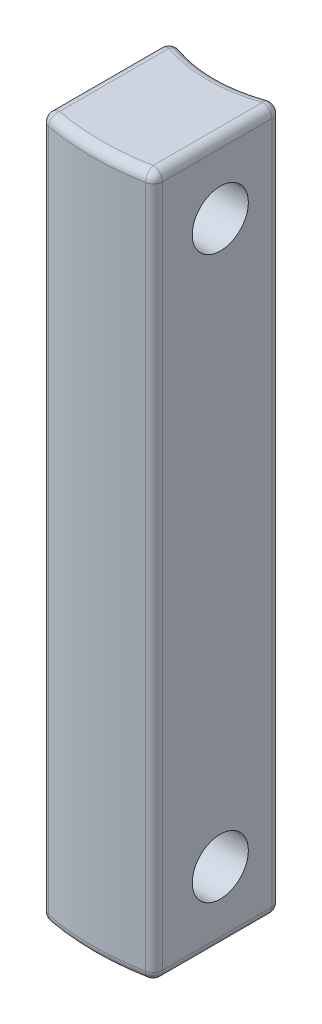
ISO-10303-21;
HEADER;
FILE_DESCRIPTION(('STEP AP214'),'2;1');
FILE_NAME('part.step','',(''),(''),'','','');
FILE_SCHEMA(('AUTOMOTIVE_DESIGN { 1 0 10303 214 1 1 1 1 }'));
ENDSEC;
DATA;
#1=APPLICATION_CONTEXT('core data for automotive mechanical design processes');
#2=APPLICATION_PROTOCOL_DEFINITION('international standard','automotive_design',2000,#1);
#3=PRODUCT_CONTEXT('',#1,'mechanical');
#4=PRODUCT('Part','Part','',(#3));
#5=PRODUCT_RELATED_PRODUCT_CATEGORY('part','',(#4));
#6=PRODUCT_DEFINITION_FORMATION('','',#4);
#7=PRODUCT_DEFINITION_CONTEXT('part definition',#1,'design');
#8=PRODUCT_DEFINITION('design','',#6,#7);
#9=PRODUCT_DEFINITION_SHAPE('','',#8);
#10=(LENGTH_UNIT() NAMED_UNIT(*) SI_UNIT(.MILLI.,.METRE.));
#11=(NAMED_UNIT(*) PLANE_ANGLE_UNIT() SI_UNIT($,.RADIAN.));
#12=(NAMED_UNIT(*) SI_UNIT($,.STERADIAN.) SOLID_ANGLE_UNIT());
#13=UNCERTAINTY_MEASURE_WITH_UNIT(LENGTH_MEASURE(1.E-05),#10,'distance_accuracy_value','');
#14=(GEOMETRIC_REPRESENTATION_CONTEXT(3) GLOBAL_UNCERTAINTY_ASSIGNED_CONTEXT((#13)) GLOBAL_UNIT_ASSIGNED_CONTEXT((#10,
#11,#12)) REPRESENTATION_CONTEXT('',''));
#15=CARTESIAN_POINT('',(0.,0.,0.));
#16=DIRECTION('',(0.,0.,1.));
#17=DIRECTION('',(1.,0.,0.));
#18=AXIS2_PLACEMENT_3D('',#15,#16,#17);
#19=CARTESIAN_POINT('',(4.25525865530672,37.5,-19.6491106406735));
#20=DIRECTION('',(0.,-1.,0.));
#21=DIRECTION('',(0.,0.,-1.));
#22=AXIS2_PLACEMENT_3D('',#19,#20,#21);
#23=CYLINDRICAL_SURFACE('',#22,14.);
#24=DIRECTION('',(0.,-1.,0.));
#25=VECTOR('',#24,1.);
#26=CARTESIAN_POINT('',(-0.411408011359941,37.5,-6.44978405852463));
#27=LINE('',#26,#25);
#28=CARTESIAN_POINT('',(-0.411408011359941,-36.5,-6.44978405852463));
#29=VERTEX_POINT('',#28);
#30=CARTESIAN_POINT('',(-0.411408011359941,36.5,-6.44978405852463));
#31=VERTEX_POINT('',#30);
#32=EDGE_CURVE('E224',#29,#31,#27,.F.);
#33=ORIENTED_EDGE('',*,*,#32,.T.);
#34=CARTESIAN_POINT('',(4.25525865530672,36.5,-19.6491106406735));
#35=DIRECTION('',(0.,1.,0.));
#36=DIRECTION('',(0.,0.,1.));
#37=AXIS2_PLACEMENT_3D('',#34,#35,#36);
#38=CIRCLE('',#37,14.);
#39=CARTESIAN_POINT('',(8.92192532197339,36.5,-6.44978405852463));
#40=VERTEX_POINT('',#39);
#41=EDGE_CURVE('E221',#31,#40,#38,.T.);
#42=ORIENTED_EDGE('',*,*,#41,.T.);
#43=DIRECTION('',(0.,-1.,0.));
#44=VECTOR('',#43,1.);
#45=CARTESIAN_POINT('',(8.92192532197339,37.5,-6.44978405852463));
#46=LINE('',#45,#44);
#47=CARTESIAN_POINT('',(8.92192532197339,-36.5,-6.44978405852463));
#48=VERTEX_POINT('',#47);
#49=EDGE_CURVE('E216',#40,#48,#46,.T.);
#50=ORIENTED_EDGE('',*,*,#49,.T.);
#51=CARTESIAN_POINT('',(4.25525865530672,-36.5,-19.6491106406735));
#52=DIRECTION('',(0.,1.,0.));
#53=DIRECTION('',(0.,0.,1.));
#54=AXIS2_PLACEMENT_3D('',#51,#52,#53);
#55=CIRCLE('',#54,14.);
#56=EDGE_CURVE('E218',#48,#29,#55,.F.);
#57=ORIENTED_EDGE('',*,*,#56,.T.);
#58=EDGE_LOOP('',(#33,#42,#50,#57));
#59=FACE_BOUND('',#58,.T.);
#60=ADVANCED_FACE('F44',(#59),#23,.F.);
#61=CARTESIAN_POINT('',(-1.74474134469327,37.5,-7.));
#62=DIRECTION('',(1.,0.,0.));
#63=DIRECTION('',(0.,0.,-1.));
#64=AXIS2_PLACEMENT_3D('',#61,#62,#63);
#65=PLANE('',#64);
#66=DIRECTION('',(0.,0.,1.));
#67=VECTOR('',#66,1.);
#68=CARTESIAN_POINT('',(-1.74474134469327,-36.5,-7.));
#69=LINE('',#68,#67);
#70=CARTESIAN_POINT('',(-1.74474134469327,-36.5,-5.50697501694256));
#71=VERTEX_POINT('',#70);
#72=CARTESIAN_POINT('',(-1.74474134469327,-36.5,6.18340966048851));
#73=VERTEX_POINT('',#72);
#74=EDGE_CURVE('E188',#71,#73,#69,.T.);
#75=ORIENTED_EDGE('',*,*,#74,.T.);
#76=DIRECTION('',(0.,-1.,0.));
#77=VECTOR('',#76,1.);
#78=CARTESIAN_POINT('',(-1.74474134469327,37.5,6.18340966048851));
#79=LINE('',#78,#77);
#80=CARTESIAN_POINT('',(-1.74474134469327,36.5,6.18340966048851));
#81=VERTEX_POINT('',#80);
#82=EDGE_CURVE('E198',#73,#81,#79,.F.);
#83=ORIENTED_EDGE('',*,*,#82,.T.);
#84=DIRECTION('',(0.,0.,1.));
#85=VECTOR('',#84,1.);
#86=CARTESIAN_POINT('',(-1.74474134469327,36.5,-7.));
#87=LINE('',#86,#85);
#88=CARTESIAN_POINT('',(-1.74474134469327,36.5,-5.50697501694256));
#89=VERTEX_POINT('',#88);
#90=EDGE_CURVE('E196',#81,#89,#87,.F.);
#91=ORIENTED_EDGE('',*,*,#90,.T.);
#92=DIRECTION('',(0.,-1.,0.));
#93=VECTOR('',#92,1.);
#94=CARTESIAN_POINT('',(-1.74474134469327,37.5,-5.50697501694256));
#95=LINE('',#94,#93);
#96=EDGE_CURVE('E194',#89,#71,#95,.T.);
#97=ORIENTED_EDGE('',*,*,#96,.T.);
#98=EDGE_LOOP('',(#75,#83,#91,#97));
#99=FACE_BOUND('',#98,.T.);
#100=CARTESIAN_POINT('',(-1.74474134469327,30.,0.));
#101=DIRECTION('',(1.,0.,0.));
#102=DIRECTION('',(0.,0.,-1.));
#103=AXIS2_PLACEMENT_3D('',#100,#101,#102);
#104=CIRCLE('',#103,3.);
#105=CARTESIAN_POINT('',(-1.74474134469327,30.,-3.));
#106=VERTEX_POINT('',#105);
#107=EDGE_CURVE('E174',#106,#106,#104,.T.);
#108=ORIENTED_EDGE('',*,*,#107,.T.);
#109=EDGE_LOOP('',(#108));
#110=FACE_BOUND('',#109,.T.);
#111=CARTESIAN_POINT('',(-1.74474134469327,-30.,0.));
#112=DIRECTION('',(1.,0.,0.));
#113=DIRECTION('',(0.,0.,-1.));
#114=AXIS2_PLACEMENT_3D('',#111,#112,#113);
#115=CIRCLE('',#114,3.);
#116=CARTESIAN_POINT('',(-1.74474134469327,-30.,-3.));
#117=VERTEX_POINT('',#116);
#118=EDGE_CURVE('E325',#117,#117,#115,.T.);
#119=ORIENTED_EDGE('',*,*,#118,.T.);
#120=EDGE_LOOP('',(#119));
#121=FACE_BOUND('',#120,.T.);
#122=ADVANCED_FACE('F361',(#99,#110,#121),#65,.F.);
#123=CARTESIAN_POINT('',(4.25525865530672,37.5,-20.3495886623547));
#124=DIRECTION('',(0.,-1.,0.));
#125=DIRECTION('',(0.,0.,-1.));
#126=AXIS2_PLACEMENT_3D('',#123,#124,#125);
#127=CYLINDRICAL_SURFACE('',#126,28.);
#128=CARTESIAN_POINT('',(4.25525865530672,36.5,-20.3495886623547));
#129=DIRECTION('',(0.,1.,0.));
#130=DIRECTION('',(0.,0.,1.));
#131=AXIS2_PLACEMENT_3D('',#128,#129,#130);
#132=CIRCLE('',#131,28.);
#133=CARTESIAN_POINT('',(9.44044384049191,36.5,7.1661133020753));
#134=VERTEX_POINT('',#133);
#135=CARTESIAN_POINT('',(-0.92992652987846,36.5,7.1661133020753));
#136=VERTEX_POINT('',#135);
#137=EDGE_CURVE('E145',#134,#136,#132,.F.);
#138=ORIENTED_EDGE('',*,*,#137,.T.);
#139=DIRECTION('',(0.,-1.,0.));
#140=VECTOR('',#139,1.);
#141=CARTESIAN_POINT('',(-0.92992652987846,37.5,7.1661133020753));
#142=LINE('',#141,#140);
#143=CARTESIAN_POINT('',(-0.92992652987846,-36.5,7.1661133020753));
#144=VERTEX_POINT('',#143);
#145=EDGE_CURVE('E190',#136,#144,#142,.T.);
#146=ORIENTED_EDGE('',*,*,#145,.T.);
#147=CARTESIAN_POINT('',(4.25525865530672,-36.5,-20.3495886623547));
#148=DIRECTION('',(0.,1.,0.));
#149=DIRECTION('',(0.,0.,1.));
#150=AXIS2_PLACEMENT_3D('',#147,#148,#149);
#151=CIRCLE('',#150,28.);
#152=CARTESIAN_POINT('',(9.44044384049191,-36.5,7.1661133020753));
#153=VERTEX_POINT('',#152);
#154=EDGE_CURVE('E143',#144,#153,#151,.T.);
#155=ORIENTED_EDGE('',*,*,#154,.T.);
#156=DIRECTION('',(0.,-1.,0.));
#157=VECTOR('',#156,1.);
#158=CARTESIAN_POINT('',(9.44044384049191,37.5,7.1661133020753));
#159=LINE('',#158,#157);
#160=EDGE_CURVE('E139',#153,#134,#159,.F.);
#161=ORIENTED_EDGE('',*,*,#160,.T.);
#162=EDGE_LOOP('',(#138,#146,#155,#161));
#163=FACE_BOUND('',#162,.T.);
#164=ADVANCED_FACE('F140',(#163),#127,.T.);
#165=CARTESIAN_POINT('',(10.2552586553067,37.5,-7.));
#166=DIRECTION('',(-1.,0.,0.));
#167=DIRECTION('',(0.,0.,1.));
#168=AXIS2_PLACEMENT_3D('',#165,#166,#167);
#169=PLANE('',#168);
#170=DIRECTION('',(0.,-1.,0.));
#171=VECTOR('',#170,1.);
#172=CARTESIAN_POINT('',(10.2552586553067,37.5,6.18340966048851));
#173=LINE('',#172,#171);
#174=CARTESIAN_POINT('',(10.2552586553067,36.5,6.18340966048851));
#175=VERTEX_POINT('',#174);
#176=CARTESIAN_POINT('',(10.2552586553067,-36.5,6.18340966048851));
#177=VERTEX_POINT('',#176);
#178=EDGE_CURVE('E69',#175,#177,#173,.T.);
#179=ORIENTED_EDGE('',*,*,#178,.T.);
#180=DIRECTION('',(0.,0.,-1.));
#181=VECTOR('',#180,1.);
#182=CARTESIAN_POINT('',(10.2552586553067,-36.5,-7.));
#183=LINE('',#182,#181);
#184=CARTESIAN_POINT('',(10.2552586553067,-36.5,-5.50697501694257));
#185=VERTEX_POINT('',#184);
#186=EDGE_CURVE('E11',#177,#185,#183,.T.);
#187=ORIENTED_EDGE('',*,*,#186,.T.);
#188=DIRECTION('',(0.,-1.,0.));
#189=VECTOR('',#188,1.);
#190=CARTESIAN_POINT('',(10.2552586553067,37.5,-5.50697501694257));
#191=LINE('',#190,#189);
#192=CARTESIAN_POINT('',(10.2552586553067,36.5,-5.50697501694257));
#193=VERTEX_POINT('',#192);
#194=EDGE_CURVE('E54',#185,#193,#191,.F.);
#195=ORIENTED_EDGE('',*,*,#194,.T.);
#196=DIRECTION('',(0.,0.,-1.));
#197=VECTOR('',#196,1.);
#198=CARTESIAN_POINT('',(10.2552586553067,36.5,7.));
#199=LINE('',#198,#197);
#200=EDGE_CURVE('E245',#193,#175,#199,.F.);
#201=ORIENTED_EDGE('',*,*,#200,.T.);
#202=EDGE_LOOP('',(#179,#187,#195,#201));
#203=FACE_BOUND('',#202,.T.);
#204=CARTESIAN_POINT('',(10.2552586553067,30.,0.));
#205=DIRECTION('',(1.,0.,0.));
#206=DIRECTION('',(0.,0.,-1.));
#207=AXIS2_PLACEMENT_3D('',#204,#205,#206);
#208=CIRCLE('',#207,3.);
#209=CARTESIAN_POINT('',(10.2552586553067,30.,-3.));
#210=VERTEX_POINT('',#209);
#211=EDGE_CURVE('E177',#210,#210,#208,.T.);
#212=ORIENTED_EDGE('',*,*,#211,.F.);
#213=EDGE_LOOP('',(#212));
#214=FACE_BOUND('',#213,.T.);
#215=CARTESIAN_POINT('',(10.2552586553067,-30.,0.));
#216=DIRECTION('',(1.,0.,0.));
#217=DIRECTION('',(0.,0.,-1.));
#218=AXIS2_PLACEMENT_3D('',#215,#216,#217);
#219=CIRCLE('',#218,3.);
#220=CARTESIAN_POINT('',(10.2552586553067,-30.,-3.));
#221=VERTEX_POINT('',#220);
#222=EDGE_CURVE('E185',#221,#221,#219,.T.);
#223=ORIENTED_EDGE('',*,*,#222,.F.);
#224=EDGE_LOOP('',(#223));
#225=FACE_BOUND('',#224,.T.);
#226=ADVANCED_FACE('F342',(#203,#214,#225),#169,.F.);
#227=CARTESIAN_POINT('',(4.25525865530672,37.5,-19.6491106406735));
#228=DIRECTION('',(0.,1.,0.));
#229=DIRECTION('',(0.,0.,1.));
#230=AXIS2_PLACEMENT_3D('',#227,#228,#229);
#231=PLANE('',#230);
#232=CARTESIAN_POINT('',(4.25525865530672,37.5,-19.6491106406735));
#233=DIRECTION('',(0.,1.,0.));
#234=DIRECTION('',(0.,0.,1.));
#235=AXIS2_PLACEMENT_3D('',#232,#233,#234);
#236=CIRCLE('',#235,15.);
#237=CARTESIAN_POINT('',(9.25525865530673,37.5,-5.50697501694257));
#238=VERTEX_POINT('',#237);
#239=CARTESIAN_POINT('',(-0.744741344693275,37.5,-5.50697501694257));
#240=VERTEX_POINT('',#239);
#241=EDGE_CURVE('E209',#238,#240,#236,.F.);
#242=ORIENTED_EDGE('',*,*,#241,.T.);
#243=DIRECTION('',(0.,0.,1.));
#244=VECTOR('',#243,1.);
#245=CARTESIAN_POINT('',(-0.744741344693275,37.5,7.));
#246=LINE('',#245,#244);
#247=CARTESIAN_POINT('',(-0.744741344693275,37.5,6.18340966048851));
#248=VERTEX_POINT('',#247);
#249=EDGE_CURVE('E215',#240,#248,#246,.T.);
#250=ORIENTED_EDGE('',*,*,#249,.T.);
#251=CARTESIAN_POINT('',(4.25525865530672,37.5,-20.3495886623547));
#252=DIRECTION('',(0.,1.,0.));
#253=DIRECTION('',(0.,0.,1.));
#254=AXIS2_PLACEMENT_3D('',#251,#252,#253);
#255=CIRCLE('',#254,27.);
#256=CARTESIAN_POINT('',(9.25525865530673,37.5,6.18340966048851));
#257=VERTEX_POINT('',#256);
#258=EDGE_CURVE('E207',#248,#257,#255,.T.);
#259=ORIENTED_EDGE('',*,*,#258,.T.);
#260=DIRECTION('',(0.,0.,-1.));
#261=VECTOR('',#260,1.);
#262=CARTESIAN_POINT('',(9.25525865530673,37.5,-7.));
#263=LINE('',#262,#261);
#264=EDGE_CURVE('E202',#257,#238,#263,.T.);
#265=ORIENTED_EDGE('',*,*,#264,.T.);
#266=EDGE_LOOP('',(#242,#250,#259,#265));
#267=FACE_BOUND('',#266,.T.);
#268=ADVANCED_FACE('F341',(#267),#231,.T.);
#269=CARTESIAN_POINT('',(4.25525865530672,-37.5,-19.6491106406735));
#270=DIRECTION('',(0.,1.,0.));
#271=DIRECTION('',(0.,0.,1.));
#272=AXIS2_PLACEMENT_3D('',#269,#270,#271);
#273=PLANE('',#272);
#274=CARTESIAN_POINT('',(4.25525865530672,-37.5,-20.3495886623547));
#275=DIRECTION('',(0.,1.,0.));
#276=DIRECTION('',(0.,0.,1.));
#277=AXIS2_PLACEMENT_3D('',#274,#275,#276);
#278=CIRCLE('',#277,27.);
#279=CARTESIAN_POINT('',(9.25525865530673,-37.5,6.18340966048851));
#280=VERTEX_POINT('',#279);
#281=CARTESIAN_POINT('',(-0.744741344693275,-37.5,6.18340966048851));
#282=VERTEX_POINT('',#281);
#283=EDGE_CURVE('E232',#280,#282,#278,.F.);
#284=ORIENTED_EDGE('',*,*,#283,.T.);
#285=DIRECTION('',(0.,0.,1.));
#286=VECTOR('',#285,1.);
#287=CARTESIAN_POINT('',(-0.744741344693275,-37.5,-19.6491106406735));
#288=LINE('',#287,#286);
#289=CARTESIAN_POINT('',(-0.744741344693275,-37.5,-5.50697501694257));
#290=VERTEX_POINT('',#289);
#291=EDGE_CURVE('E238',#282,#290,#288,.F.);
#292=ORIENTED_EDGE('',*,*,#291,.T.);
#293=CARTESIAN_POINT('',(4.25525865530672,-37.5,-19.6491106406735));
#294=DIRECTION('',(0.,1.,0.));
#295=DIRECTION('',(0.,0.,1.));
#296=AXIS2_PLACEMENT_3D('',#293,#294,#295);
#297=CIRCLE('',#296,15.);
#298=CARTESIAN_POINT('',(9.25525865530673,-37.5,-5.50697501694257));
#299=VERTEX_POINT('',#298);
#300=EDGE_CURVE('E235',#290,#299,#297,.T.);
#301=ORIENTED_EDGE('',*,*,#300,.T.);
#302=DIRECTION('',(0.,0.,-1.));
#303=VECTOR('',#302,1.);
#304=CARTESIAN_POINT('',(9.25525865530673,-37.5,-19.6491106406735));
#305=LINE('',#304,#303);
#306=EDGE_CURVE('E230',#299,#280,#305,.F.);
#307=ORIENTED_EDGE('',*,*,#306,.T.);
#308=EDGE_LOOP('',(#284,#292,#301,#307));
#309=FACE_BOUND('',#308,.T.);
#310=ADVANCED_FACE('F349',(#309),#273,.F.);
#311=CARTESIAN_POINT('',(-1.74474134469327,-30.,0.));
#312=DIRECTION('',(1.,0.,0.));
#313=DIRECTION('',(0.,0.,-1.));
#314=AXIS2_PLACEMENT_3D('',#311,#312,#313);
#315=CYLINDRICAL_SURFACE('',#314,3.);
#316=ORIENTED_EDGE('',*,*,#118,.F.);
#317=EDGE_LOOP('',(#316));
#318=FACE_BOUND('',#317,.T.);
#319=ORIENTED_EDGE('',*,*,#222,.T.);
#320=EDGE_LOOP('',(#319));
#321=FACE_BOUND('',#320,.T.);
#322=ADVANCED_FACE('F347',(#318,#321),#315,.F.);
#323=CARTESIAN_POINT('',(-1.74474134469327,30.,0.));
#324=DIRECTION('',(1.,0.,0.));
#325=DIRECTION('',(0.,0.,-1.));
#326=AXIS2_PLACEMENT_3D('',#323,#324,#325);
#327=CYLINDRICAL_SURFACE('',#326,3.);
#328=ORIENTED_EDGE('',*,*,#107,.F.);
#329=EDGE_LOOP('',(#328));
#330=FACE_BOUND('',#329,.T.);
#331=ORIENTED_EDGE('',*,*,#211,.T.);
#332=EDGE_LOOP('',(#331));
#333=FACE_BOUND('',#332,.T.);
#334=ADVANCED_FACE('F339',(#330,#333),#327,.F.);
#335=CARTESIAN_POINT('',(9.25525865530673,37.5,-5.50697501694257));
#336=DIRECTION('',(0.,-1.,0.));
#337=DIRECTION('',(0.,0.,-1.));
#338=AXIS2_PLACEMENT_3D('',#335,#336,#337);
#339=CYLINDRICAL_SURFACE('',#338,1.);
#340=CARTESIAN_POINT('',(9.25525865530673,36.5,-5.50697501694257));
#341=DIRECTION('',(0.,1.,0.));
#342=DIRECTION('',(0.,0.,1.));
#343=AXIS2_PLACEMENT_3D('',#340,#341,#342);
#344=CIRCLE('',#343,1.);
#345=EDGE_CURVE('E47',#193,#40,#344,.T.);
#346=ORIENTED_EDGE('',*,*,#345,.F.);
#347=ORIENTED_EDGE('',*,*,#194,.F.);
#348=CARTESIAN_POINT('',(9.25525865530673,-36.5,-5.50697501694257));
#349=DIRECTION('',(0.,-1.,0.));
#350=DIRECTION('',(0.,0.,-1.));
#351=AXIS2_PLACEMENT_3D('',#348,#349,#350);
#352=CIRCLE('',#351,1.);
#353=EDGE_CURVE('E313',#48,#185,#352,.T.);
#354=ORIENTED_EDGE('',*,*,#353,.F.);
#355=ORIENTED_EDGE('',*,*,#49,.F.);
#356=EDGE_LOOP('',(#346,#347,#354,#355));
#357=FACE_BOUND('',#356,.T.);
#358=ADVANCED_FACE('F50',(#357),#339,.T.);
#359=CARTESIAN_POINT('',(9.25525865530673,36.5,-5.50697501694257));
#360=DIRECTION('',(0.,1.,0.));
#361=DIRECTION('',(0.,0.,1.));
#362=AXIS2_PLACEMENT_3D('',#359,#360,#361);
#363=SPHERICAL_SURFACE('',#362,1.);
#364=CARTESIAN_POINT('',(9.25525865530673,36.5,-5.50697501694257));
#365=DIRECTION('',(0.,0.,-1.));
#366=DIRECTION('',(-1.,0.,0.));
#367=AXIS2_PLACEMENT_3D('',#364,#365,#366);
#368=CIRCLE('',#367,1.);
#369=EDGE_CURVE('E308',#193,#238,#368,.F.);
#370=ORIENTED_EDGE('',*,*,#369,.F.);
#371=ORIENTED_EDGE('',*,*,#345,.T.);
#372=CARTESIAN_POINT('',(9.25525865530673,36.5,-5.50697501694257));
#373=DIRECTION('',(0.942809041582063,0.,-0.333333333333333));
#374=DIRECTION('',(-0.333333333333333,0.,-0.942809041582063));
#375=AXIS2_PLACEMENT_3D('',#372,#373,#374);
#376=CIRCLE('',#375,1.);
#377=EDGE_CURVE('E315',#238,#40,#376,.F.);
#378=ORIENTED_EDGE('',*,*,#377,.F.);
#379=EDGE_LOOP('',(#370,#371,#378));
#380=FACE_BOUND('',#379,.T.);
#381=ADVANCED_FACE('F436',(#380),#363,.T.);
#382=CARTESIAN_POINT('',(9.25525865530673,-36.5,-5.50697501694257));
#383=DIRECTION('',(0.,-1.,0.));
#384=DIRECTION('',(0.,0.,-1.));
#385=AXIS2_PLACEMENT_3D('',#382,#383,#384);
#386=SPHERICAL_SURFACE('',#385,1.);
#387=CARTESIAN_POINT('',(9.25525865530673,-36.5,-5.50697501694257));
#388=DIRECTION('',(0.942809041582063,0.,-0.333333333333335));
#389=DIRECTION('',(-0.333333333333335,0.,-0.942809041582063));
#390=AXIS2_PLACEMENT_3D('',#387,#388,#389);
#391=CIRCLE('',#390,1.);
#392=EDGE_CURVE('E305',#48,#299,#391,.F.);
#393=ORIENTED_EDGE('',*,*,#392,.F.);
#394=ORIENTED_EDGE('',*,*,#353,.T.);
#395=CARTESIAN_POINT('',(9.25525865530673,-36.5,-5.50697501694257));
#396=DIRECTION('',(0.,0.,-1.));
#397=DIRECTION('',(0.,1.,0.));
#398=AXIS2_PLACEMENT_3D('',#395,#396,#397);
#399=CIRCLE('',#398,1.);
#400=EDGE_CURVE('E64',#299,#185,#399,.F.);
#401=ORIENTED_EDGE('',*,*,#400,.F.);
#402=EDGE_LOOP('',(#393,#394,#401));
#403=FACE_BOUND('',#402,.T.);
#404=ADVANCED_FACE('F433',(#403),#386,.T.);
#405=CARTESIAN_POINT('',(4.25525865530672,36.5,-19.6491106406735));
#406=DIRECTION('',(0.,1.,0.));
#407=DIRECTION('',(0.,0.,1.));
#408=AXIS2_PLACEMENT_3D('',#405,#406,#407);
#409=TOROIDAL_SURFACE('',#408,15.,1.);
#410=ORIENTED_EDGE('',*,*,#377,.T.);
#411=ORIENTED_EDGE('',*,*,#41,.F.);
#412=CARTESIAN_POINT('',(-0.744741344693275,36.5,-5.50697501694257));
#413=DIRECTION('',(-0.942809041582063,0.,-0.333333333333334));
#414=DIRECTION('',(-0.333333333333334,0.,0.942809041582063));
#415=AXIS2_PLACEMENT_3D('',#412,#413,#414);
#416=CIRCLE('',#415,1.);
#417=EDGE_CURVE('E295',#240,#31,#416,.T.);
#418=ORIENTED_EDGE('',*,*,#417,.F.);
#419=ORIENTED_EDGE('',*,*,#241,.F.);
#420=EDGE_LOOP('',(#410,#411,#418,#419));
#421=FACE_BOUND('',#420,.T.);
#422=ADVANCED_FACE('F429',(#421),#409,.T.);
#423=CARTESIAN_POINT('',(9.25525865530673,36.5,-19.6491106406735));
#424=DIRECTION('',(0.,0.,1.));
#425=DIRECTION('',(1.,0.,0.));
#426=AXIS2_PLACEMENT_3D('',#423,#424,#425);
#427=CYLINDRICAL_SURFACE('',#426,1.);
#428=ORIENTED_EDGE('',*,*,#369,.T.);
#429=ORIENTED_EDGE('',*,*,#264,.F.);
#430=CARTESIAN_POINT('',(9.25525865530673,36.5,6.18340966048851));
#431=DIRECTION('',(0.,0.,1.));
#432=DIRECTION('',(0.,-1.,0.));
#433=AXIS2_PLACEMENT_3D('',#430,#431,#432);
#434=CIRCLE('',#433,1.);
#435=EDGE_CURVE('E160',#175,#257,#434,.T.);
#436=ORIENTED_EDGE('',*,*,#435,.F.);
#437=ORIENTED_EDGE('',*,*,#200,.F.);
#438=EDGE_LOOP('',(#428,#429,#436,#437));
#439=FACE_BOUND('',#438,.T.);
#440=ADVANCED_FACE('F428',(#439),#427,.T.);
#441=CARTESIAN_POINT('',(9.25525865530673,37.5,6.18340966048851));
#442=DIRECTION('',(0.,-1.,0.));
#443=DIRECTION('',(0.,0.,-1.));
#444=AXIS2_PLACEMENT_3D('',#441,#442,#443);
#445=CYLINDRICAL_SURFACE('',#444,1.);
#446=CARTESIAN_POINT('',(9.25525865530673,-36.5,6.18340966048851));
#447=DIRECTION('',(0.,-1.,0.));
#448=DIRECTION('',(0.,0.,-1.));
#449=AXIS2_PLACEMENT_3D('',#446,#447,#448);
#450=CIRCLE('',#449,1.);
#451=EDGE_CURVE('E156',#177,#153,#450,.T.);
#452=ORIENTED_EDGE('',*,*,#451,.F.);
#453=ORIENTED_EDGE('',*,*,#178,.F.);
#454=CARTESIAN_POINT('',(9.25525865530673,36.5,6.18340966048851));
#455=DIRECTION('',(0.,1.,0.));
#456=DIRECTION('',(0.,0.,1.));
#457=AXIS2_PLACEMENT_3D('',#454,#455,#456);
#458=CIRCLE('',#457,1.);
#459=EDGE_CURVE('E155',#134,#175,#458,.T.);
#460=ORIENTED_EDGE('',*,*,#459,.F.);
#461=ORIENTED_EDGE('',*,*,#160,.F.);
#462=EDGE_LOOP('',(#452,#453,#460,#461));
#463=FACE_BOUND('',#462,.T.);
#464=ADVANCED_FACE('F153',(#463),#445,.T.);
#465=CARTESIAN_POINT('',(9.25525865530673,-36.5,-7.));
#466=DIRECTION('',(0.,0.,-1.));
#467=DIRECTION('',(-1.,0.,0.));
#468=AXIS2_PLACEMENT_3D('',#465,#466,#467);
#469=CYLINDRICAL_SURFACE('',#468,1.);
#470=ORIENTED_EDGE('',*,*,#400,.T.);
#471=ORIENTED_EDGE('',*,*,#186,.F.);
#472=CARTESIAN_POINT('',(9.25525865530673,-36.5,6.18340966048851));
#473=DIRECTION('',(0.,0.,1.));
#474=DIRECTION('',(1.,0.,0.));
#475=AXIS2_PLACEMENT_3D('',#472,#473,#474);
#476=CIRCLE('',#475,1.);
#477=EDGE_CURVE('E288',#280,#177,#476,.T.);
#478=ORIENTED_EDGE('',*,*,#477,.F.);
#479=ORIENTED_EDGE('',*,*,#306,.F.);
#480=EDGE_LOOP('',(#470,#471,#478,#479));
#481=FACE_BOUND('',#480,.T.);
#482=ADVANCED_FACE('F416',(#481),#469,.T.);
#483=CARTESIAN_POINT('',(4.25525865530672,-36.5,-19.6491106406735));
#484=DIRECTION('',(0.,1.,0.));
#485=DIRECTION('',(0.,0.,1.));
#486=AXIS2_PLACEMENT_3D('',#483,#484,#485);
#487=TOROIDAL_SURFACE('',#486,15.,1.);
#488=ORIENTED_EDGE('',*,*,#392,.T.);
#489=ORIENTED_EDGE('',*,*,#300,.F.);
#490=CARTESIAN_POINT('',(-0.744741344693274,-36.5,-5.50697501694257));
#491=DIRECTION('',(-0.942809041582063,0.,-0.333333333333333));
#492=DIRECTION('',(-0.333333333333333,0.,0.942809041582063));
#493=AXIS2_PLACEMENT_3D('',#490,#491,#492);
#494=CIRCLE('',#493,1.);
#495=EDGE_CURVE('E285',#29,#290,#494,.T.);
#496=ORIENTED_EDGE('',*,*,#495,.F.);
#497=ORIENTED_EDGE('',*,*,#56,.F.);
#498=EDGE_LOOP('',(#488,#489,#496,#497));
#499=FACE_BOUND('',#498,.T.);
#500=ADVANCED_FACE('F418',(#499),#487,.T.);
#501=CARTESIAN_POINT('',(-0.744741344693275,37.5,-5.50697501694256));
#502=DIRECTION('',(0.,-1.,0.));
#503=DIRECTION('',(0.,0.,-1.));
#504=AXIS2_PLACEMENT_3D('',#501,#502,#503);
#505=CYLINDRICAL_SURFACE('',#504,1.);
#506=CARTESIAN_POINT('',(-0.744741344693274,36.5,-5.50697501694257));
#507=DIRECTION('',(0.,1.,0.));
#508=DIRECTION('',(0.,0.,1.));
#509=AXIS2_PLACEMENT_3D('',#506,#507,#508);
#510=CIRCLE('',#509,1.);
#511=EDGE_CURVE('E296',#31,#89,#510,.T.);
#512=ORIENTED_EDGE('',*,*,#511,.F.);
#513=ORIENTED_EDGE('',*,*,#32,.F.);
#514=CARTESIAN_POINT('',(-0.744741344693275,-36.5,-5.50697501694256));
#515=DIRECTION('',(0.,-1.,0.));
#516=DIRECTION('',(0.,0.,-1.));
#517=AXIS2_PLACEMENT_3D('',#514,#515,#516);
#518=CIRCLE('',#517,1.);
#519=EDGE_CURVE('E279',#71,#29,#518,.T.);
#520=ORIENTED_EDGE('',*,*,#519,.F.);
#521=ORIENTED_EDGE('',*,*,#96,.F.);
#522=EDGE_LOOP('',(#512,#513,#520,#521));
#523=FACE_BOUND('',#522,.T.);
#524=ADVANCED_FACE('F415',(#523),#505,.T.);
#525=CARTESIAN_POINT('',(-0.744741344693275,36.5,-5.50697501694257));
#526=DIRECTION('',(0.,1.,0.));
#527=DIRECTION('',(0.,0.,1.));
#528=AXIS2_PLACEMENT_3D('',#525,#526,#527);
#529=SPHERICAL_SURFACE('',#528,1.);
#530=ORIENTED_EDGE('',*,*,#417,.T.);
#531=ORIENTED_EDGE('',*,*,#511,.T.);
#532=CARTESIAN_POINT('',(-0.744741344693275,36.5,-5.50697501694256));
#533=DIRECTION('',(0.,0.,-1.));
#534=DIRECTION('',(0.,1.,0.));
#535=AXIS2_PLACEMENT_3D('',#532,#533,#534);
#536=CIRCLE('',#535,1.);
#537=EDGE_CURVE('E166',#240,#89,#536,.F.);
#538=ORIENTED_EDGE('',*,*,#537,.F.);
#539=EDGE_LOOP('',(#530,#531,#538));
#540=FACE_BOUND('',#539,.T.);
#541=ADVANCED_FACE('F406',(#540),#529,.T.);
#542=CARTESIAN_POINT('',(9.25525865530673,36.5,6.18340966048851));
#543=DIRECTION('',(0.,1.,0.));
#544=DIRECTION('',(0.,0.,1.));
#545=AXIS2_PLACEMENT_3D('',#542,#543,#544);
#546=SPHERICAL_SURFACE('',#545,1.);
#547=ORIENTED_EDGE('',*,*,#459,.T.);
#548=ORIENTED_EDGE('',*,*,#435,.T.);
#549=CARTESIAN_POINT('',(9.25525865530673,36.5,6.18340966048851));
#550=DIRECTION('',(0.982703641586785,0.,-0.185185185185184));
#551=DIRECTION('',(-0.185185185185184,0.,-0.982703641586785));
#552=AXIS2_PLACEMENT_3D('',#549,#550,#551);
#553=CIRCLE('',#552,1.);
#554=EDGE_CURVE('E161',#134,#257,#553,.F.);
#555=ORIENTED_EDGE('',*,*,#554,.F.);
#556=EDGE_LOOP('',(#547,#548,#555));
#557=FACE_BOUND('',#556,.T.);
#558=ADVANCED_FACE('F165',(#557),#546,.T.);
#559=CARTESIAN_POINT('',(9.25525865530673,-36.5,6.18340966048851));
#560=DIRECTION('',(0.,-1.,0.));
#561=DIRECTION('',(0.,0.,-1.));
#562=AXIS2_PLACEMENT_3D('',#559,#560,#561);
#563=SPHERICAL_SURFACE('',#562,1.);
#564=ORIENTED_EDGE('',*,*,#477,.T.);
#565=ORIENTED_EDGE('',*,*,#451,.T.);
#566=CARTESIAN_POINT('',(9.25525865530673,-36.5,6.18340966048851));
#567=DIRECTION('',(0.982703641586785,0.,-0.185185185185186));
#568=DIRECTION('',(-0.185185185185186,0.,-0.982703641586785));
#569=AXIS2_PLACEMENT_3D('',#566,#567,#568);
#570=CIRCLE('',#569,1.);
#571=EDGE_CURVE('E169',#280,#153,#570,.F.);
#572=ORIENTED_EDGE('',*,*,#571,.F.);
#573=EDGE_LOOP('',(#564,#565,#572));
#574=FACE_BOUND('',#573,.T.);
#575=ADVANCED_FACE('F405',(#574),#563,.T.);
#576=CARTESIAN_POINT('',(-0.744741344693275,-36.5,-5.50697501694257));
#577=DIRECTION('',(0.,-1.,0.));
#578=DIRECTION('',(0.,0.,-1.));
#579=AXIS2_PLACEMENT_3D('',#576,#577,#578);
#580=SPHERICAL_SURFACE('',#579,1.);
#581=ORIENTED_EDGE('',*,*,#519,.T.);
#582=ORIENTED_EDGE('',*,*,#495,.T.);
#583=CARTESIAN_POINT('',(-0.744741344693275,-36.5,-5.50697501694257));
#584=DIRECTION('',(0.,0.,-1.));
#585=DIRECTION('',(-1.,0.,0.));
#586=AXIS2_PLACEMENT_3D('',#583,#584,#585);
#587=CIRCLE('',#586,1.);
#588=EDGE_CURVE('E270',#71,#290,#587,.F.);
#589=ORIENTED_EDGE('',*,*,#588,.F.);
#590=EDGE_LOOP('',(#581,#582,#589));
#591=FACE_BOUND('',#590,.T.);
#592=ADVANCED_FACE('F397',(#591),#580,.T.);
#593=CARTESIAN_POINT('',(-0.744741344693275,36.5,-19.6491106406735));
#594=DIRECTION('',(0.,0.,-1.));
#595=DIRECTION('',(-1.,0.,0.));
#596=AXIS2_PLACEMENT_3D('',#593,#594,#595);
#597=CYLINDRICAL_SURFACE('',#596,1.);
#598=ORIENTED_EDGE('',*,*,#537,.T.);
#599=ORIENTED_EDGE('',*,*,#90,.F.);
#600=CARTESIAN_POINT('',(-0.744741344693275,36.5,6.18340966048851));
#601=DIRECTION('',(0.,0.,1.));
#602=DIRECTION('',(1.,0.,0.));
#603=AXIS2_PLACEMENT_3D('',#600,#601,#602);
#604=CIRCLE('',#603,1.);
#605=EDGE_CURVE('E264',#248,#81,#604,.T.);
#606=ORIENTED_EDGE('',*,*,#605,.F.);
#607=ORIENTED_EDGE('',*,*,#249,.F.);
#608=EDGE_LOOP('',(#598,#599,#606,#607));
#609=FACE_BOUND('',#608,.T.);
#610=ADVANCED_FACE('F394',(#609),#597,.T.);
#611=CARTESIAN_POINT('',(4.25525865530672,36.5,-20.3495886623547));
#612=DIRECTION('',(0.,1.,0.));
#613=DIRECTION('',(0.,0.,1.));
#614=AXIS2_PLACEMENT_3D('',#611,#612,#613);
#615=TOROIDAL_SURFACE('',#614,27.,1.);
#616=ORIENTED_EDGE('',*,*,#554,.T.);
#617=ORIENTED_EDGE('',*,*,#258,.F.);
#618=CARTESIAN_POINT('',(-0.744741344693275,36.5,6.18340966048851));
#619=DIRECTION('',(-0.982703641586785,0.,-0.185185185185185));
#620=DIRECTION('',(-0.185185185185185,0.,0.982703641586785));
#621=AXIS2_PLACEMENT_3D('',#618,#619,#620);
#622=CIRCLE('',#621,1.);
#623=EDGE_CURVE('E175',#136,#248,#622,.T.);
#624=ORIENTED_EDGE('',*,*,#623,.F.);
#625=ORIENTED_EDGE('',*,*,#137,.F.);
#626=EDGE_LOOP('',(#616,#617,#624,#625));
#627=FACE_BOUND('',#626,.T.);
#628=ADVANCED_FACE('F171',(#627),#615,.T.);
#629=CARTESIAN_POINT('',(4.25525865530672,-36.5,-20.3495886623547));
#630=DIRECTION('',(0.,1.,0.));
#631=DIRECTION('',(0.,0.,1.));
#632=AXIS2_PLACEMENT_3D('',#629,#630,#631);
#633=TOROIDAL_SURFACE('',#632,27.,1.);
#634=ORIENTED_EDGE('',*,*,#571,.T.);
#635=ORIENTED_EDGE('',*,*,#154,.F.);
#636=CARTESIAN_POINT('',(-0.744741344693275,-36.5,6.18340966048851));
#637=DIRECTION('',(-0.982703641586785,0.,-0.185185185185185));
#638=DIRECTION('',(-0.185185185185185,0.,0.982703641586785));
#639=AXIS2_PLACEMENT_3D('',#636,#637,#638);
#640=CIRCLE('',#639,1.);
#641=EDGE_CURVE('E256',#282,#144,#640,.T.);
#642=ORIENTED_EDGE('',*,*,#641,.F.);
#643=ORIENTED_EDGE('',*,*,#283,.F.);
#644=EDGE_LOOP('',(#634,#635,#642,#643));
#645=FACE_BOUND('',#644,.T.);
#646=ADVANCED_FACE('F389',(#645),#633,.T.);
#647=CARTESIAN_POINT('',(-0.744741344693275,-36.5,-7.));
#648=DIRECTION('',(0.,0.,1.));
#649=DIRECTION('',(1.,0.,0.));
#650=AXIS2_PLACEMENT_3D('',#647,#648,#649);
#651=CYLINDRICAL_SURFACE('',#650,1.);
#652=ORIENTED_EDGE('',*,*,#588,.T.);
#653=ORIENTED_EDGE('',*,*,#291,.F.);
#654=CARTESIAN_POINT('',(-0.744741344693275,-36.5,6.18340966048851));
#655=DIRECTION('',(0.,0.,1.));
#656=DIRECTION('',(0.,-1.,0.));
#657=AXIS2_PLACEMENT_3D('',#654,#655,#656);
#658=CIRCLE('',#657,1.);
#659=EDGE_CURVE('E253',#73,#282,#658,.T.);
#660=ORIENTED_EDGE('',*,*,#659,.F.);
#661=ORIENTED_EDGE('',*,*,#74,.F.);
#662=EDGE_LOOP('',(#652,#653,#660,#661));
#663=FACE_BOUND('',#662,.T.);
#664=ADVANCED_FACE('F381',(#663),#651,.T.);
#665=CARTESIAN_POINT('',(-0.744741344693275,36.5,6.18340966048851));
#666=DIRECTION('',(0.,1.,0.));
#667=DIRECTION('',(0.,0.,1.));
#668=AXIS2_PLACEMENT_3D('',#665,#666,#667);
#669=SPHERICAL_SURFACE('',#668,1.);
#670=ORIENTED_EDGE('',*,*,#623,.T.);
#671=ORIENTED_EDGE('',*,*,#605,.T.);
#672=CARTESIAN_POINT('',(-0.744741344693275,36.5,6.18340966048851));
#673=DIRECTION('',(0.,1.,0.));
#674=DIRECTION('',(0.,0.,1.));
#675=AXIS2_PLACEMENT_3D('',#672,#673,#674);
#676=CIRCLE('',#675,1.);
#677=EDGE_CURVE('E255',#136,#81,#676,.F.);
#678=ORIENTED_EDGE('',*,*,#677,.F.);
#679=EDGE_LOOP('',(#670,#671,#678));
#680=FACE_BOUND('',#679,.T.);
#681=ADVANCED_FACE('F379',(#680),#669,.T.);
#682=CARTESIAN_POINT('',(-0.744741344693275,-36.5,6.18340966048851));
#683=DIRECTION('',(0.,-1.,0.));
#684=DIRECTION('',(0.,0.,-1.));
#685=AXIS2_PLACEMENT_3D('',#682,#683,#684);
#686=SPHERICAL_SURFACE('',#685,1.);
#687=ORIENTED_EDGE('',*,*,#659,.T.);
#688=ORIENTED_EDGE('',*,*,#641,.T.);
#689=CARTESIAN_POINT('',(-0.744741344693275,-36.5,6.18340966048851));
#690=DIRECTION('',(0.,-1.,0.));
#691=DIRECTION('',(0.,0.,-1.));
#692=AXIS2_PLACEMENT_3D('',#689,#690,#691);
#693=CIRCLE('',#692,1.);
#694=EDGE_CURVE('E248',#73,#144,#693,.F.);
#695=ORIENTED_EDGE('',*,*,#694,.F.);
#696=EDGE_LOOP('',(#687,#688,#695));
#697=FACE_BOUND('',#696,.T.);
#698=ADVANCED_FACE('F376',(#697),#686,.T.);
#699=CARTESIAN_POINT('',(-0.744741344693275,37.5,6.18340966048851));
#700=DIRECTION('',(0.,-1.,0.));
#701=DIRECTION('',(0.,0.,-1.));
#702=AXIS2_PLACEMENT_3D('',#699,#700,#701);
#703=CYLINDRICAL_SURFACE('',#702,1.);
#704=ORIENTED_EDGE('',*,*,#677,.T.);
#705=ORIENTED_EDGE('',*,*,#82,.F.);
#706=ORIENTED_EDGE('',*,*,#694,.T.);
#707=ORIENTED_EDGE('',*,*,#145,.F.);
#708=EDGE_LOOP('',(#704,#705,#706,#707));
#709=FACE_BOUND('',#708,.T.);
#710=ADVANCED_FACE('F373',(#709),#703,.T.);
#711=CLOSED_SHELL('',(#60,#122,#164,#226,#268,#310,#322,#334,#358,#381,#404,#422,#440,#464,#482,
#500,#524,#541,#558,#575,#592,#610,#628,#646,#664,#681,#698,#710));
#712=MANIFOLD_SOLID_BREP('B2',#711);
#713=ADVANCED_BREP_SHAPE_REPRESENTATION('',(#18,#712),#14);
#714=SHAPE_DEFINITION_REPRESENTATION(#9,#713);
ENDSEC;
END-ISO-10303-21;
